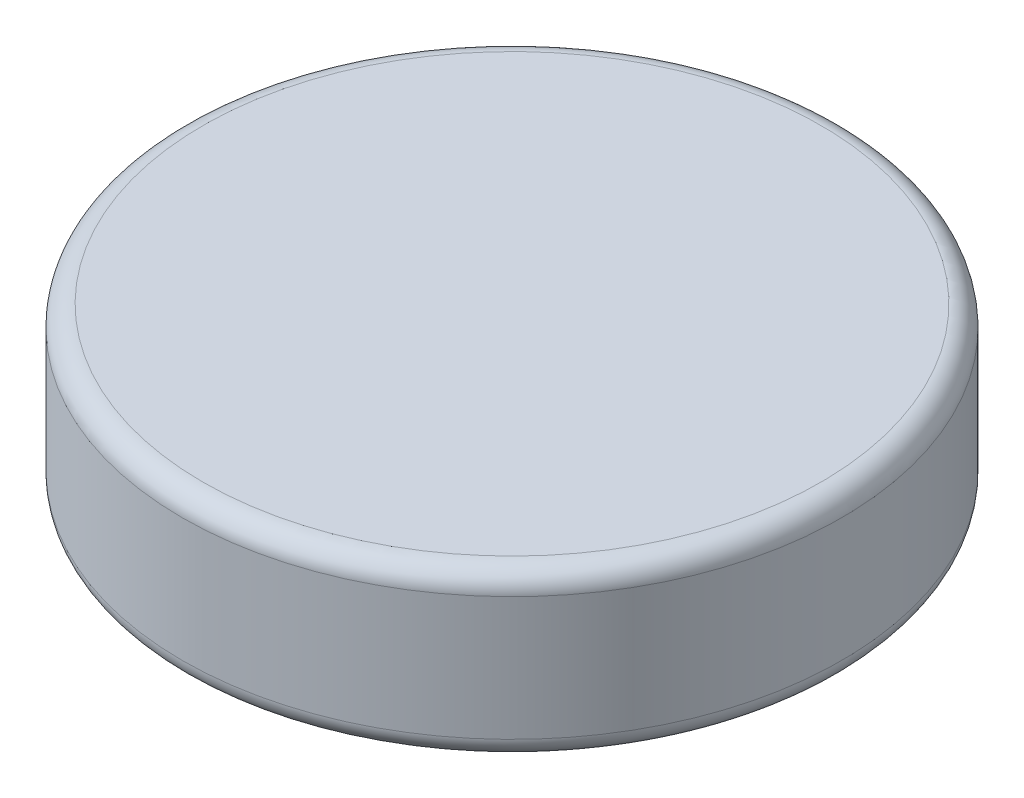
from build123d import *

# Parameters (mm, degrees)
SKETCH1_R           = 4.064
BOSS_EXTRUDE1_DEPTH = 2.032
FILLET1_R           = 0.254


with BuildPart() as part:
    # Sketch1 → Boss-Extrude1 (new body)
    with BuildSketch(Plane(origin=(0, 0, 0), x_dir=(1, 0, 0), z_dir=(0, 1, 0))):
        with Locations(Location((0, 0, 0), (0, 0, 270))):
            Circle(SKETCH1_R)
    extrude(amount=BOSS_EXTRUDE1_DEPTH)

    # Fillet1
    fillet1_edges = [part.edges().sort_by_distance(p)[0] for p in [
        (0, 0, -4.064),
        (0, 2.032, -4.064),
    ]]
    fillet(fillet1_edges, radius=FILLET1_R)


solid = part.part
